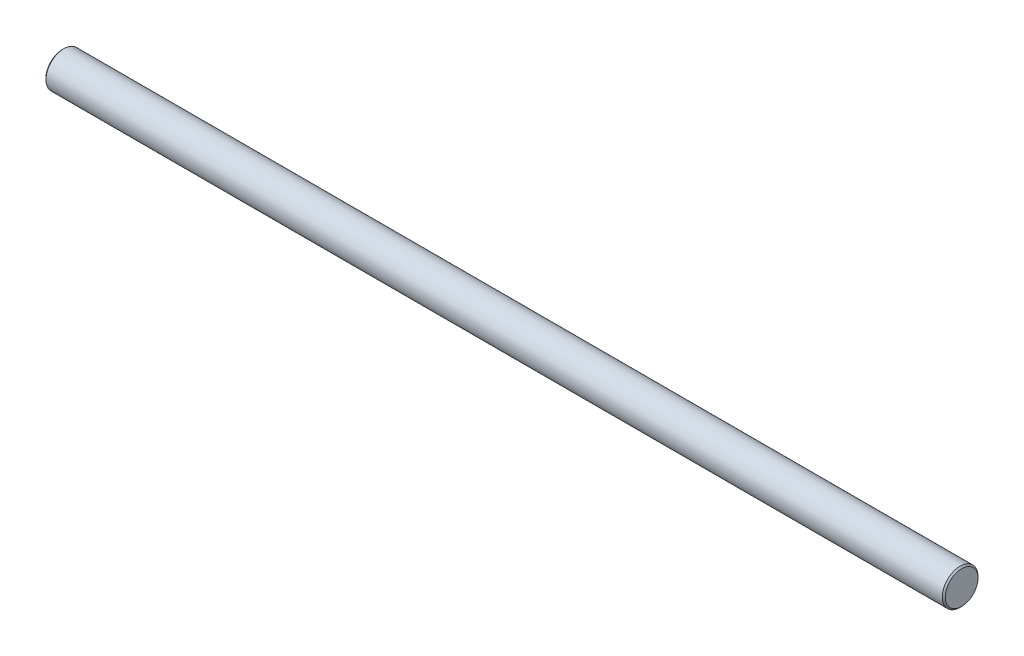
from build123d import *

# Parameters (mm, degrees)
SKETCH_1_R      = 3
EXTRUDE_1_DEPTH = 151
CHAMFER_1_SIZE  = 0.25


with BuildPart() as part:
    # Sketch 1 → Extrude 1 (new body)
    with BuildSketch(Plane(origin=(0, 0, 0), x_dir=(0, 0, -1), z_dir=(1, 0, 0))):
        Circle(SKETCH_1_R)
    extrude(amount=EXTRUDE_1_DEPTH)

    # Chamfer 1
    chamfer_1_edges = [part.edges().sort_by_distance(p)[0] for p in [
        (0, 0, 3),
        (151, 0, 3),
    ]]
    chamfer(chamfer_1_edges, length=CHAMFER_1_SIZE)


solid = part.part
